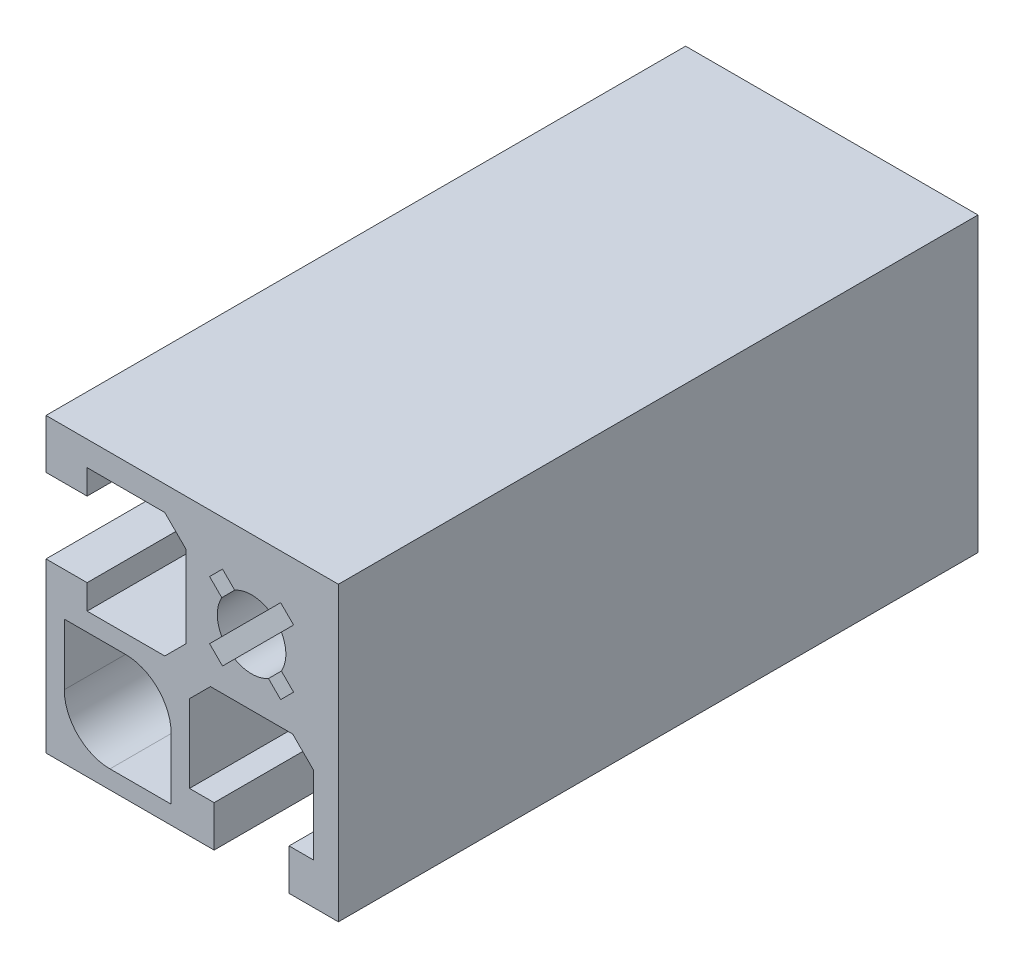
from build123d import *

# Parameters (mm, degrees)
EXTRUDE1_DEPTH      = 35
EXTRUDE1_DEPTH_BACK = 35


with BuildPart() as part:
    # Sketch1 → Extrude1 (new, two sides: drawn at the far end of the back side and taken through both)
    with BuildSketch(Plane.XY.offset(-EXTRUDE1_DEPTH_BACK)):
        Polygon((-22.5, -22.5), (-4.1, -22.5), (-4.1, -18), (-6.8, -18), (-6.8, -9.5), (-4.5, -7.2), (4.5, -7.2), (6.8, -9.5), (6.8, -18), (4.1, -18), (4.1, -22.5), (9.5, -22.5), (9.5, 9.5), (-22.5, 9.5), (-22.5, 4.1), (-18, 4.1), (-18, 6.8), (-9.5, 6.8), (-7.2, 4.5), (-7.2, -4.5), (-9.5, -6.8), (-18, -6.8), (-18, -4.1), (-22.5, -4.1), align=None)
        with BuildLine():
            Line((-8.8, -20.5), (-15.5, -20.5))
            ThreePointArc((-15.5, -20.5), (-19.035533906, -19.035533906), (-20.5, -15.5))
            Line((-20.5, -15.5), (-20.5, -8.8))
            Line((-20.5, -8.8), (-13.8, -8.8))
            ThreePointArc((-13.8, -8.8), (-10.264466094, -10.264466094), (-8.8, -13.8))
            Line((-8.8, -13.8), (-8.8, -20.5))
        make_face(mode=Mode.SUBTRACT)
        with BuildLine():
            Line((-4.596194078, -3.181980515), (-3.262737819, -1.848524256))
            ThreePointArc((-3.262737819, -1.848524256), (-3.75, 0), (-3.262737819, 1.848524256))
            Line((-3.262737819, 1.848524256), (-4.596194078, 3.181980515))
            Line((-4.596194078, 3.181980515), (-3.181980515, 4.596194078))
            Line((-3.181980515, 4.596194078), (-1.848524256, 3.262737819))
            ThreePointArc((-1.848524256, 3.262737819), (0, 3.75), (1.848524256, 3.262737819))
            Line((1.848524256, 3.262737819), (3.181980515, 4.596194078))
            Line((3.181980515, 4.596194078), (4.596194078, 3.181980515))
            Line((4.596194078, 3.181980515), (3.262737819, 1.848524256))
            ThreePointArc((3.262737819, 1.848524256), (3.75, 0), (3.262737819, -1.848524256))
            Line((3.262737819, -1.848524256), (4.596194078, -3.181980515))
            Line((4.596194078, -3.181980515), (3.181980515, -4.596194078))
            Line((3.181980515, -4.596194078), (1.848524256, -3.262737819))
            ThreePointArc((1.848524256, -3.262737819), (0, -3.75), (-1.848524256, -3.262737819))
            Line((-1.848524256, -3.262737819), (-3.181980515, -4.596194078))
            Line((-3.181980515, -4.596194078), (-4.596194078, -3.181980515))
        make_face(mode=Mode.SUBTRACT)
    extrude(amount=EXTRUDE1_DEPTH + EXTRUDE1_DEPTH_BACK)


solid = part.part
